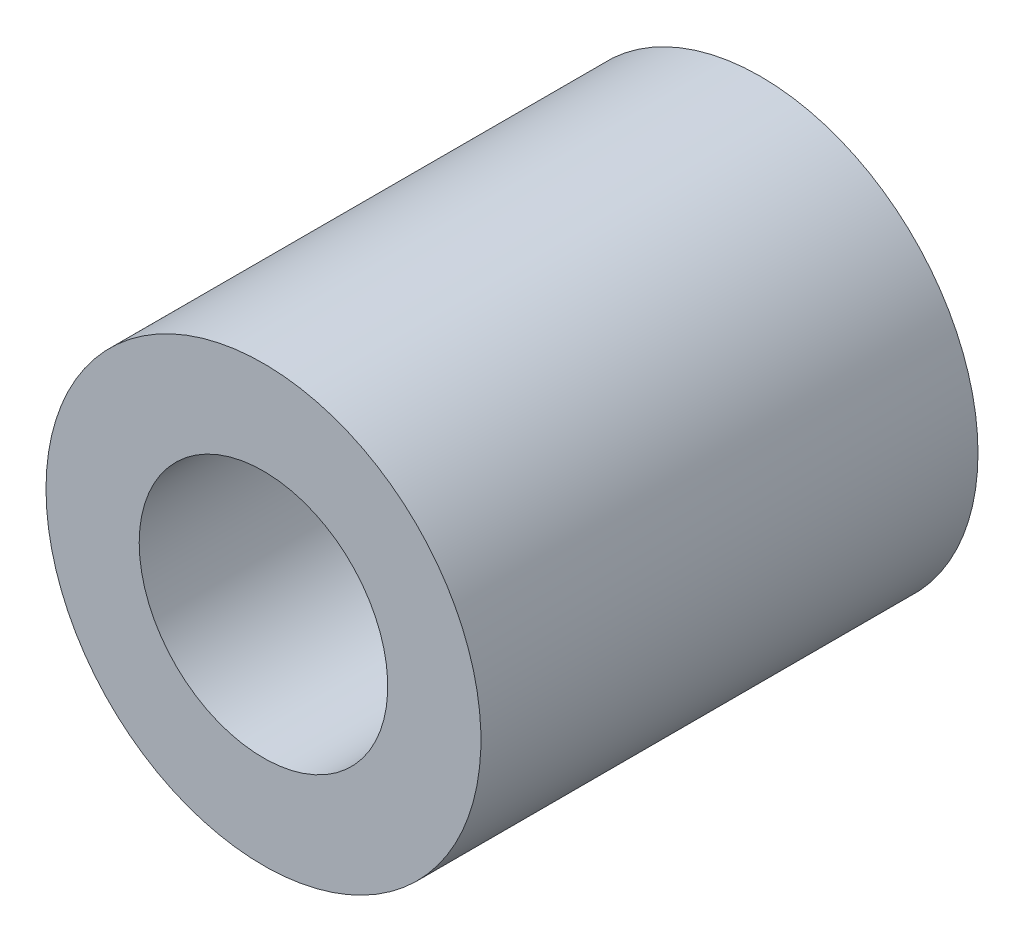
ISO-10303-21;
HEADER;
FILE_DESCRIPTION(('STEP AP214'),'2;1');
FILE_NAME('part.step','',(''),(''),'','','');
FILE_SCHEMA(('AUTOMOTIVE_DESIGN { 1 0 10303 214 1 1 1 1 }'));
ENDSEC;
DATA;
#1=APPLICATION_CONTEXT('core data for automotive mechanical design processes');
#2=APPLICATION_PROTOCOL_DEFINITION('international standard','automotive_design',2000,#1);
#3=PRODUCT_CONTEXT('',#1,'mechanical');
#4=PRODUCT('Part','Part','',(#3));
#5=PRODUCT_RELATED_PRODUCT_CATEGORY('part','',(#4));
#6=PRODUCT_DEFINITION_FORMATION('','',#4);
#7=PRODUCT_DEFINITION_CONTEXT('part definition',#1,'design');
#8=PRODUCT_DEFINITION('design','',#6,#7);
#9=PRODUCT_DEFINITION_SHAPE('','',#8);
#10=(LENGTH_UNIT() NAMED_UNIT(*) SI_UNIT(.MILLI.,.METRE.));
#11=(NAMED_UNIT(*) PLANE_ANGLE_UNIT() SI_UNIT($,.RADIAN.));
#12=(NAMED_UNIT(*) SI_UNIT($,.STERADIAN.) SOLID_ANGLE_UNIT());
#13=UNCERTAINTY_MEASURE_WITH_UNIT(LENGTH_MEASURE(1.E-05),#10,'distance_accuracy_value','');
#14=(GEOMETRIC_REPRESENTATION_CONTEXT(3) GLOBAL_UNCERTAINTY_ASSIGNED_CONTEXT((#13)) GLOBAL_UNIT_ASSIGNED_CONTEXT((#10,
#11,#12)) REPRESENTATION_CONTEXT('',''));
#15=CARTESIAN_POINT('',(0.,0.,0.));
#16=DIRECTION('',(0.,0.,1.));
#17=DIRECTION('',(1.,0.,0.));
#18=AXIS2_PLACEMENT_3D('',#15,#16,#17);
#19=CARTESIAN_POINT('',(-9.82293418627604,33.5933023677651,0.));
#20=DIRECTION('',(0.,0.,1.));
#21=DIRECTION('',(1.,0.,0.));
#22=AXIS2_PLACEMENT_3D('',#19,#20,#21);
#23=PLANE('',#22);
#24=CARTESIAN_POINT('',(-9.82293418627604,33.5933023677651,0.));
#25=DIRECTION('',(0.,0.,1.));
#26=DIRECTION('',(1.,0.,0.));
#27=AXIS2_PLACEMENT_3D('',#24,#25,#26);
#28=CIRCLE('',#27,3.5);
#29=CARTESIAN_POINT('',(-6.32293418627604,33.5933023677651,0.));
#30=VERTEX_POINT('',#29);
#31=EDGE_CURVE('E373',#30,#30,#28,.T.);
#32=ORIENTED_EDGE('',*,*,#31,.F.);
#33=EDGE_LOOP('',(#32));
#34=FACE_BOUND('',#33,.T.);
#35=CARTESIAN_POINT('',(-9.82293418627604,33.5933023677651,0.));
#36=DIRECTION('',(0.,0.,1.));
#37=DIRECTION('',(1.,0.,0.));
#38=AXIS2_PLACEMENT_3D('',#35,#36,#37);
#39=CIRCLE('',#38,2.);
#40=CARTESIAN_POINT('',(-7.82293418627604,33.5933023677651,0.));
#41=VERTEX_POINT('',#40);
#42=EDGE_CURVE('E382',#41,#41,#39,.T.);
#43=ORIENTED_EDGE('',*,*,#42,.T.);
#44=EDGE_LOOP('',(#43));
#45=FACE_BOUND('',#44,.T.);
#46=ADVANCED_FACE('F366',(#34,#45),#23,.F.);
#47=CARTESIAN_POINT('',(-9.82293418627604,33.5933023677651,17.8994949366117));
#48=DIRECTION('',(0.,0.,-1.));
#49=DIRECTION('',(-1.,0.,0.));
#50=AXIS2_PLACEMENT_3D('',#47,#48,#49);
#51=CYLINDRICAL_SURFACE('',#50,3.5);
#52=CARTESIAN_POINT('',(-9.82293418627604,33.5933023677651,8.00000000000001));
#53=DIRECTION('',(0.,0.,-1.));
#54=DIRECTION('',(-1.,0.,0.));
#55=AXIS2_PLACEMENT_3D('',#52,#53,#54);
#56=CIRCLE('',#55,3.5);
#57=CARTESIAN_POINT('',(-13.322934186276,33.5933023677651,8.00000000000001));
#58=VERTEX_POINT('',#57);
#59=EDGE_CURVE('E377',#58,#58,#56,.T.);
#60=ORIENTED_EDGE('',*,*,#59,.T.);
#61=EDGE_LOOP('',(#60));
#62=FACE_BOUND('',#61,.T.);
#63=ORIENTED_EDGE('',*,*,#31,.T.);
#64=EDGE_LOOP('',(#63));
#65=FACE_BOUND('',#64,.T.);
#66=ADVANCED_FACE('F390',(#62,#65),#51,.T.);
#67=CARTESIAN_POINT('',(-9.82293418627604,33.5933023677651,17.8994949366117));
#68=DIRECTION('',(0.,0.,-1.));
#69=DIRECTION('',(-1.,0.,0.));
#70=AXIS2_PLACEMENT_3D('',#67,#68,#69);
#71=CYLINDRICAL_SURFACE('',#70,2.);
#72=CARTESIAN_POINT('',(-9.82293418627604,33.5933023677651,8.00000000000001));
#73=DIRECTION('',(0.,0.,-1.));
#74=DIRECTION('',(-1.,0.,0.));
#75=AXIS2_PLACEMENT_3D('',#72,#73,#74);
#76=CIRCLE('',#75,2.);
#77=CARTESIAN_POINT('',(-11.822934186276,33.5933023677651,8.00000000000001));
#78=VERTEX_POINT('',#77);
#79=EDGE_CURVE('E10',#78,#78,#76,.T.);
#80=ORIENTED_EDGE('',*,*,#79,.F.);
#81=EDGE_LOOP('',(#80));
#82=FACE_BOUND('',#81,.T.);
#83=ORIENTED_EDGE('',*,*,#42,.F.);
#84=EDGE_LOOP('',(#83));
#85=FACE_BOUND('',#84,.T.);
#86=ADVANCED_FACE('F388',(#82,#85),#71,.F.);
#87=CARTESIAN_POINT('',(0.,20.,8.00000000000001));
#88=DIRECTION('',(0.,0.,-1.));
#89=DIRECTION('',(-1.,0.,0.));
#90=AXIS2_PLACEMENT_3D('',#87,#88,#89);
#91=PLANE('',#90);
#92=ORIENTED_EDGE('',*,*,#79,.T.);
#93=EDGE_LOOP('',(#92));
#94=FACE_BOUND('',#93,.T.);
#95=ORIENTED_EDGE('',*,*,#59,.F.);
#96=EDGE_LOOP('',(#95));
#97=FACE_BOUND('',#96,.T.);
#98=ADVANCED_FACE('F368',(#94,#97),#91,.F.);
#99=CLOSED_SHELL('',(#46,#66,#86,#98));
#100=MANIFOLD_SOLID_BREP('B2',#99);
#101=ADVANCED_BREP_SHAPE_REPRESENTATION('',(#18,#100),#14);
#102=SHAPE_DEFINITION_REPRESENTATION(#9,#101);
ENDSEC;
END-ISO-10303-21;
